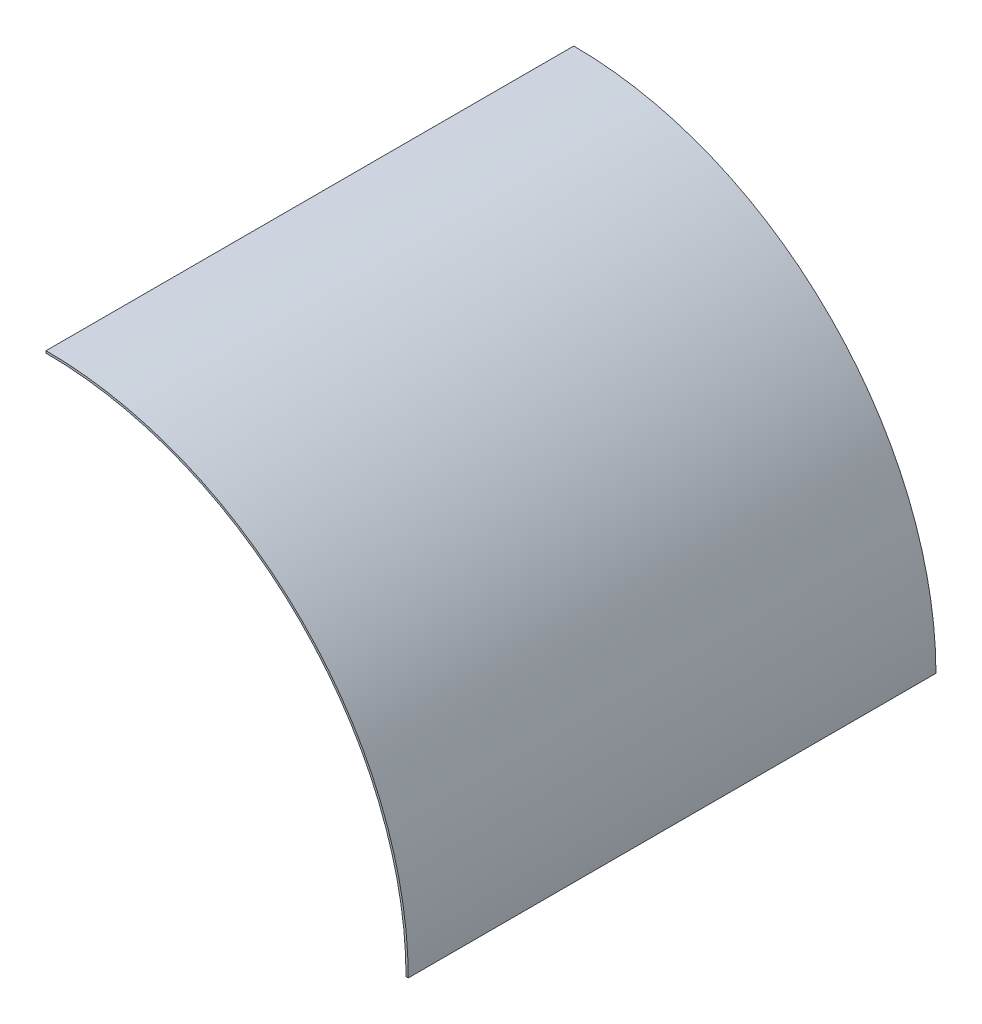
from build123d import *

# Parameters (mm, degrees)
BOSS_EXTRUDE1_DEPTH = 3000


with BuildPart() as part:
    # Sketch1 → Boss-Extrude1 (new body)
    with BuildSketch(Plane.XY):
        with BuildLine():
            Line((0, 2059), (0, 2046.5))
            ThreePointArc((0, 2046.5), (1447.094027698, 1447.094027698), (2046.5, 0))
            Line((2046.5, 0), (2059, 0))
            ThreePointArc((2059, 0), (1455.932862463, 1455.932862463), (0, 2059))
        make_face()
    extrude(amount=-BOSS_EXTRUDE1_DEPTH)


solid = part.part
